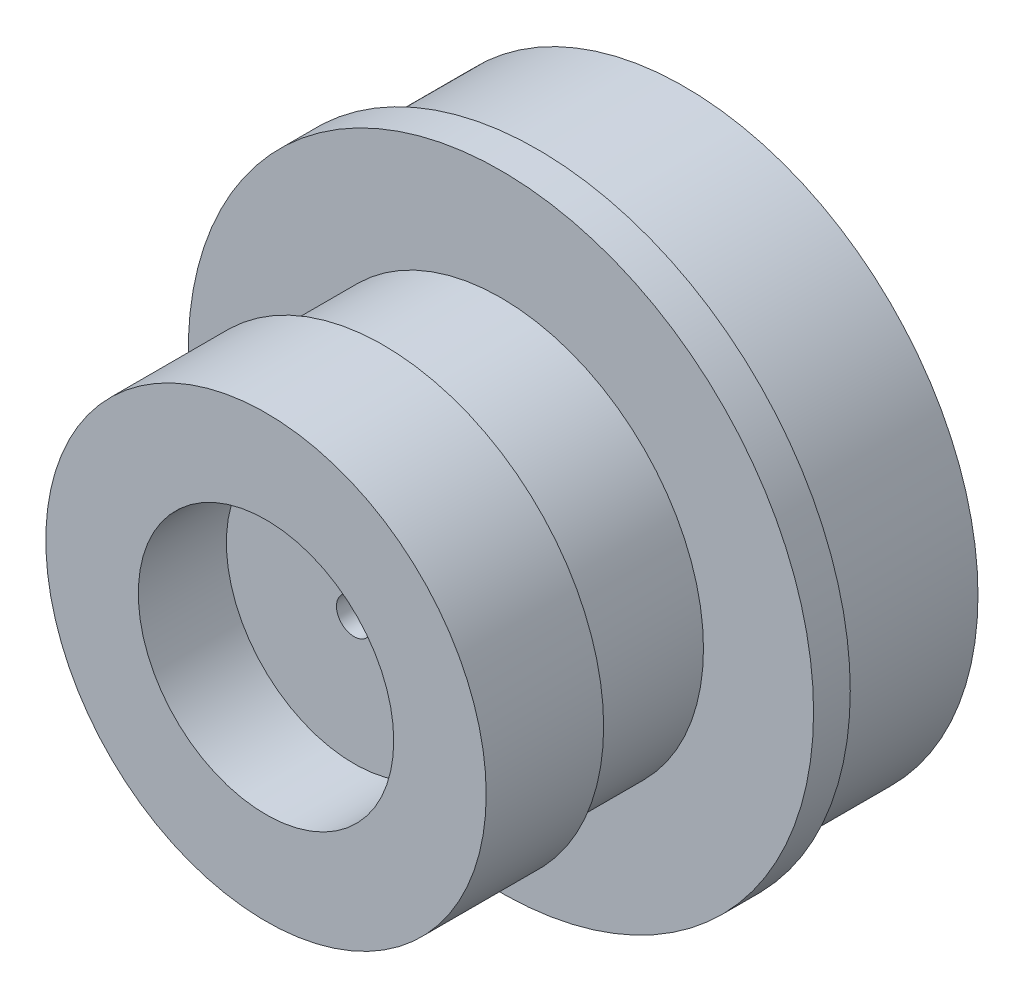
from build123d import *

# Parameters (mm, degrees)
SKETCH1_R          = 25.4
EXTRUDE1_DEPTH     = 12.7
SKETCH2_R          = 27.051
EXTRUDE2_DEPTH     = 3.175
SKETCH3_R          = 17.526
EXTRUDE3_DEPTH     = 10.16
SKETCH4_R          = 19.05
EXTRUDE4_DEPTH     = 10.16
SKETCH5_R          = 11.049
CUT_EXTRUDE1_DEPTH = 7.62
SKETCH6_R          = 1.524
CUT_EXTRUDE2_DEPTH = 48.749804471
SKETCH7_R          = 14.351
CUT_EXTRUDE4_DEPTH = 25.4


with BuildPart() as part:
    # Sketch1 → Extrude1 (new body)
    with BuildSketch(Plane.XY):
        Circle(SKETCH1_R)
    extrude(amount=EXTRUDE1_DEPTH)

    # Sketch2 → Extrude2 (add)
    with BuildSketch(Plane.XY.offset(12.7)):
        Circle(SKETCH2_R)
    extrude(amount=EXTRUDE2_DEPTH)

    # Sketch3 → Extrude3 (add)
    with BuildSketch(Plane.XY.offset(15.875)):
        Circle(SKETCH3_R)
    extrude(amount=EXTRUDE3_DEPTH)

    # Sketch4 → Extrude4 (add)
    with BuildSketch(Plane.XY.offset(26.035)):
        Circle(SKETCH4_R)
    extrude(amount=EXTRUDE4_DEPTH)

    # Sketch5 → Cut-Extrude1 (cut)
    with BuildSketch(Plane.XY.offset(36.195)):
        Circle(SKETCH5_R)
    extrude(amount=-CUT_EXTRUDE1_DEPTH, mode=Mode.SUBTRACT)

    # Sketch6 → Cut-Extrude2 (cut, through all)
    with BuildSketch(Plane.XY.offset(28.575)):
        Circle(SKETCH6_R)
    extrude(amount=-CUT_EXTRUDE2_DEPTH, mode=Mode.SUBTRACT)

    # Sketch7 → Cut-Extrude4 (cut)
    with BuildSketch(Plane(origin=(0, 0, 0), x_dir=(-1, 0, 0), z_dir=(0, 0, -1))):
        Circle(SKETCH7_R)
    extrude(amount=-CUT_EXTRUDE4_DEPTH, mode=Mode.SUBTRACT)


solid = part.part
